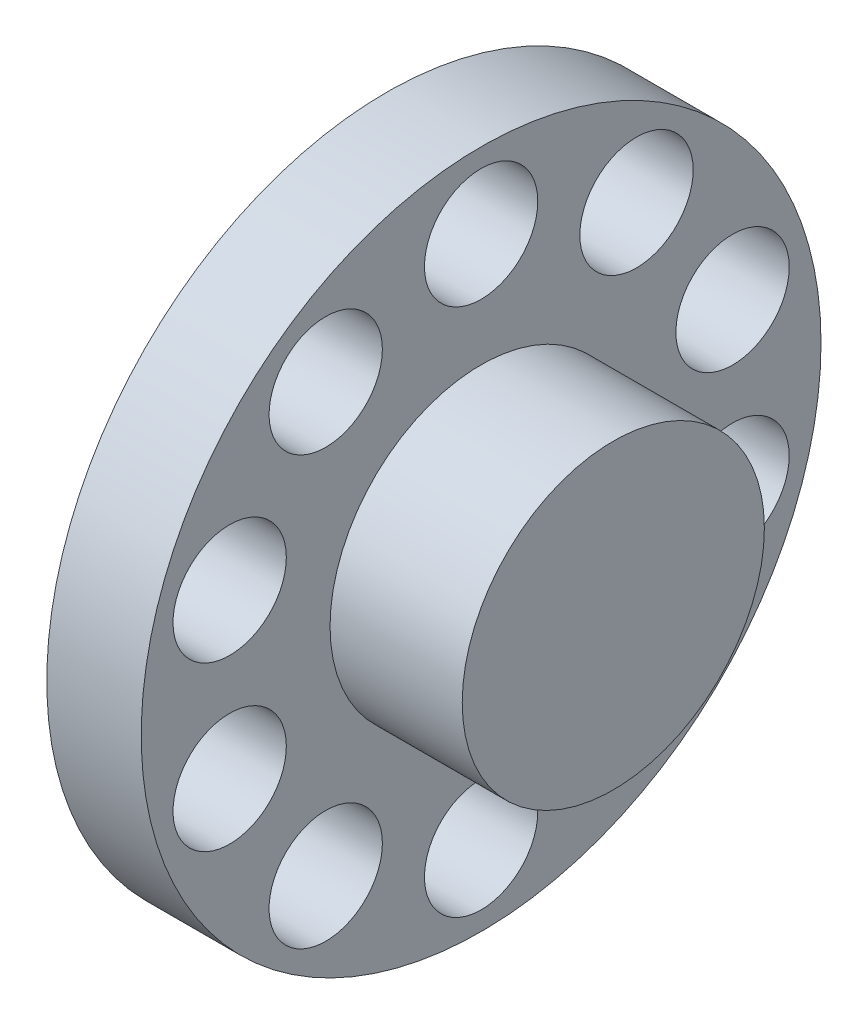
from build123d import *

# Parameters (mm, degrees)
SZKIC_OTWORU_MOCOWANIA_R = 15
OTW_R_MOCOWANIA_DEPTH    = 141.712472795
POWIELENIE_OTWOR_W_COUNT = 10


with BuildPart() as part:
    # Szkic bazowy → Obr_t bazowy (revolve)
    with BuildSketch(Plane.XY, mode=Mode.PRIVATE) as obr_t_bazowy_sk:
        Polygon((0, 0), (0, 90), (25, 90), (25, 40), (60, 40), (60, 0), align=None)
    revolve(obr_t_bazowy_sk.sketch.rotate(Axis((0, 0, 0), (-1, 0, 0)), 90), axis=Axis((0, 0, 0), (-1, 0, 0)))

    # Szkic otworu mocowania → Otw_r mocowania (cut, through all)
    with BuildSketch(Plane.ZY):
        with Locations((0, 70)):
            Circle(SZKIC_OTWORU_MOCOWANIA_R)
    otw_r_mocowania = extrude(amount=-OTW_R_MOCOWANIA_DEPTH, mode=Mode.SUBTRACT)

    # Powielenie otwor_w: Otw_r mocowania ×10 about axis
    powielenie_otwor_w_axis = Axis((0, 0, 0), (1, 0, 0))
    for i in range(1, POWIELENIE_OTWOR_W_COUNT):
        add(otw_r_mocowania.rotate(powielenie_otwor_w_axis, i * 360 / POWIELENIE_OTWOR_W_COUNT), mode=Mode.SUBTRACT)


solid = part.part
